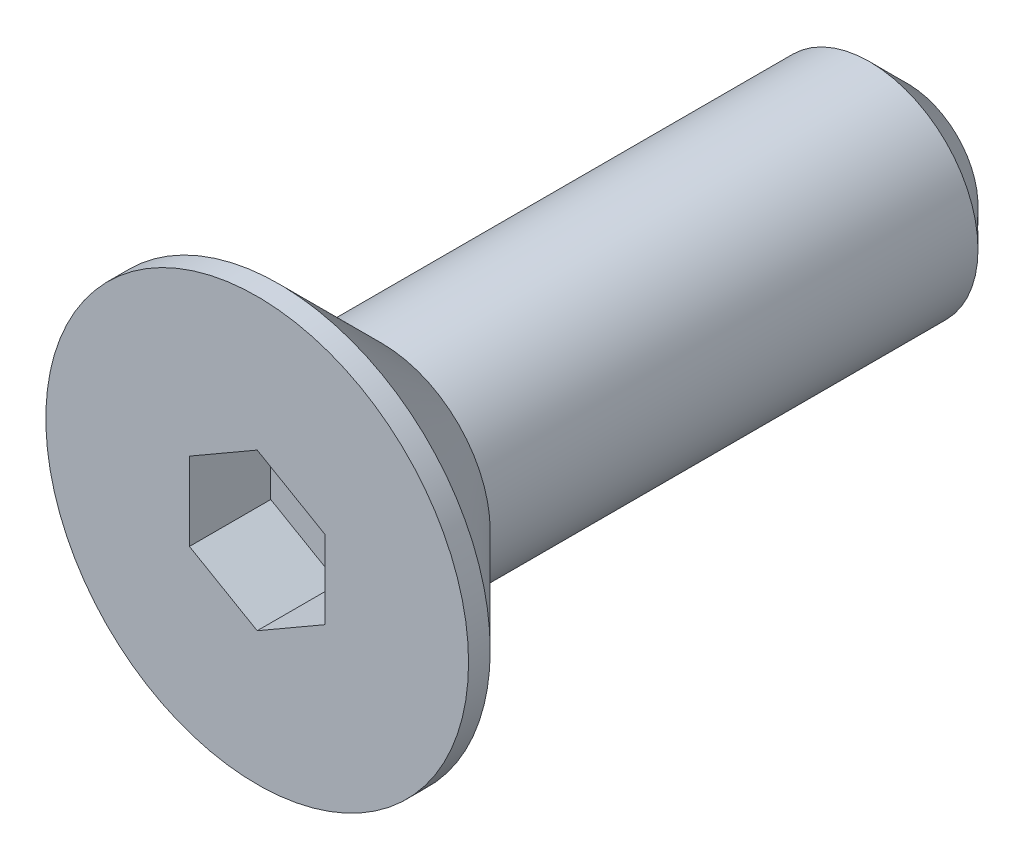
ISO-10303-21;
HEADER;
FILE_DESCRIPTION(('STEP AP214'),'2;1');
FILE_NAME('part.step','',(''),(''),'','','');
FILE_SCHEMA(('AUTOMOTIVE_DESIGN { 1 0 10303 214 1 1 1 1 }'));
ENDSEC;
DATA;
#1=APPLICATION_CONTEXT('core data for automotive mechanical design processes');
#2=APPLICATION_PROTOCOL_DEFINITION('international standard','automotive_design',2000,#1);
#3=PRODUCT_CONTEXT('',#1,'mechanical');
#4=PRODUCT('Part','Part','',(#3));
#5=PRODUCT_RELATED_PRODUCT_CATEGORY('part','',(#4));
#6=PRODUCT_DEFINITION_FORMATION('','',#4);
#7=PRODUCT_DEFINITION_CONTEXT('part definition',#1,'design');
#8=PRODUCT_DEFINITION('design','',#6,#7);
#9=PRODUCT_DEFINITION_SHAPE('','',#8);
#10=(LENGTH_UNIT() NAMED_UNIT(*) SI_UNIT(.MILLI.,.METRE.));
#11=(NAMED_UNIT(*) PLANE_ANGLE_UNIT() SI_UNIT($,.RADIAN.));
#12=(NAMED_UNIT(*) SI_UNIT($,.STERADIAN.) SOLID_ANGLE_UNIT());
#13=UNCERTAINTY_MEASURE_WITH_UNIT(LENGTH_MEASURE(1.E-05),#10,'distance_accuracy_value','');
#14=(GEOMETRIC_REPRESENTATION_CONTEXT(3) GLOBAL_UNCERTAINTY_ASSIGNED_CONTEXT((#13)) GLOBAL_UNIT_ASSIGNED_CONTEXT((#10,
#11,#12)) REPRESENTATION_CONTEXT('',''));
#15=CARTESIAN_POINT('',(0.,0.,0.));
#16=DIRECTION('',(0.,0.,1.));
#17=DIRECTION('',(1.,0.,0.));
#18=AXIS2_PLACEMENT_3D('',#15,#16,#17);
#19=CARTESIAN_POINT('',(0.,0.,0.));
#20=DIRECTION('',(0.,0.,1.));
#21=DIRECTION('',(1.,0.,0.));
#22=AXIS2_PLACEMENT_3D('',#19,#20,#21);
#23=PLANE('',#22);
#24=DIRECTION('',(-0.866025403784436,0.5,0.));
#25=VECTOR('',#24,1.);
#26=CARTESIAN_POINT('',(1.25,0.721687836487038,0.));
#27=LINE('',#26,#25);
#28=CARTESIAN_POINT('',(1.25,0.721687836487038,0.));
#29=VERTEX_POINT('',#28);
#30=CARTESIAN_POINT('',(0.,1.44337567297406,0.));
#31=VERTEX_POINT('',#30);
#32=EDGE_CURVE('E29',#29,#31,#27,.T.);
#33=ORIENTED_EDGE('',*,*,#32,.F.);
#34=DIRECTION('',(0.,1.,0.));
#35=VECTOR('',#34,1.);
#36=CARTESIAN_POINT('',(1.25,-0.721687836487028,0.));
#37=LINE('',#36,#35);
#38=CARTESIAN_POINT('',(1.25,-0.721687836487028,0.));
#39=VERTEX_POINT('',#38);
#40=EDGE_CURVE('E112',#39,#29,#37,.T.);
#41=ORIENTED_EDGE('',*,*,#40,.F.);
#42=DIRECTION('',(0.866025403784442,0.5,0.));
#43=VECTOR('',#42,1.);
#44=CARTESIAN_POINT('',(0.,-1.44337567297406,0.));
#45=LINE('',#44,#43);
#46=CARTESIAN_POINT('',(0.,-1.44337567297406,0.));
#47=VERTEX_POINT('',#46);
#48=EDGE_CURVE('E110',#47,#39,#45,.T.);
#49=ORIENTED_EDGE('',*,*,#48,.F.);
#50=DIRECTION('',(0.866025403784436,-0.5,0.));
#51=VECTOR('',#50,1.);
#52=CARTESIAN_POINT('',(-1.25,-0.721687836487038,0.));
#53=LINE('',#52,#51);
#54=CARTESIAN_POINT('',(-1.25,-0.721687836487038,0.));
#55=VERTEX_POINT('',#54);
#56=EDGE_CURVE('E77',#55,#47,#53,.T.);
#57=ORIENTED_EDGE('',*,*,#56,.F.);
#58=DIRECTION('',(0.,-1.,0.));
#59=VECTOR('',#58,1.);
#60=CARTESIAN_POINT('',(-1.25,0.721687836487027,0.));
#61=LINE('',#60,#59);
#62=CARTESIAN_POINT('',(-1.25,0.721687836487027,0.));
#63=VERTEX_POINT('',#62);
#64=EDGE_CURVE('E106',#63,#55,#61,.T.);
#65=ORIENTED_EDGE('',*,*,#64,.F.);
#66=DIRECTION('',(-0.866025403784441,-0.5,0.));
#67=VECTOR('',#66,1.);
#68=CARTESIAN_POINT('',(0.,1.44337567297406,0.));
#69=LINE('',#68,#67);
#70=EDGE_CURVE('E103',#31,#63,#69,.T.);
#71=ORIENTED_EDGE('',*,*,#70,.F.);
#72=EDGE_LOOP('',(#33,#41,#49,#57,#65,#71));
#73=FACE_BOUND('',#72,.T.);
#74=CARTESIAN_POINT('',(0.,0.,0.));
#75=DIRECTION('',(0.,0.,1.));
#76=DIRECTION('',(1.,0.,0.));
#77=AXIS2_PLACEMENT_3D('',#74,#75,#76);
#78=CIRCLE('',#77,3.9);
#79=CARTESIAN_POINT('',(3.9,0.,0.));
#80=VERTEX_POINT('',#79);
#81=EDGE_CURVE('E127',#80,#80,#78,.T.);
#82=ORIENTED_EDGE('',*,*,#81,.T.);
#83=EDGE_LOOP('',(#82));
#84=FACE_BOUND('',#83,.T.);
#85=ADVANCED_FACE('F14',(#73,#84),#23,.T.);
#86=CARTESIAN_POINT('',(0.,0.,0.));
#87=DIRECTION('',(0.,0.,1.));
#88=DIRECTION('',(1.,0.,0.));
#89=AXIS2_PLACEMENT_3D('',#86,#87,#88);
#90=CYLINDRICAL_SURFACE('',#89,3.9);
#91=CARTESIAN_POINT('',(0.,0.,-0.399999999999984));
#92=DIRECTION('',(0.,0.,1.));
#93=DIRECTION('',(1.,0.,0.));
#94=AXIS2_PLACEMENT_3D('',#91,#92,#93);
#95=CIRCLE('',#94,3.9);
#96=CARTESIAN_POINT('',(3.9,0.,-0.399999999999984));
#97=VERTEX_POINT('',#96);
#98=EDGE_CURVE('E124',#97,#97,#95,.T.);
#99=ORIENTED_EDGE('',*,*,#98,.T.);
#100=EDGE_LOOP('',(#99));
#101=FACE_BOUND('',#100,.T.);
#102=ORIENTED_EDGE('',*,*,#81,.F.);
#103=EDGE_LOOP('',(#102));
#104=FACE_BOUND('',#103,.T.);
#105=ADVANCED_FACE('F151',(#101,#104),#90,.T.);
#106=CARTESIAN_POINT('',(0.,0.,-0.399999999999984));
#107=DIRECTION('',(0.,0.,1.));
#108=DIRECTION('',(1.,0.,0.));
#109=AXIS2_PLACEMENT_3D('',#106,#107,#108);
#110=CONICAL_SURFACE('',#109,3.9,0.785398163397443);
#111=CARTESIAN_POINT('',(0.,0.,-2.3));
#112=DIRECTION('',(0.,0.,1.));
#113=DIRECTION('',(1.,0.,0.));
#114=AXIS2_PLACEMENT_3D('',#111,#112,#113);
#115=CIRCLE('',#114,2.);
#116=CARTESIAN_POINT('',(2.,0.,-2.3));
#117=VERTEX_POINT('',#116);
#118=EDGE_CURVE('E116',#117,#117,#115,.T.);
#119=ORIENTED_EDGE('',*,*,#118,.T.);
#120=EDGE_LOOP('',(#119));
#121=FACE_BOUND('',#120,.T.);
#122=ORIENTED_EDGE('',*,*,#98,.F.);
#123=EDGE_LOOP('',(#122));
#124=FACE_BOUND('',#123,.T.);
#125=ADVANCED_FACE('F157',(#121,#124),#110,.T.);
#126=CARTESIAN_POINT('',(0.,0.,0.));
#127=DIRECTION('',(0.,0.,1.));
#128=DIRECTION('',(1.,0.,0.));
#129=AXIS2_PLACEMENT_3D('',#126,#127,#128);
#130=CYLINDRICAL_SURFACE('',#129,2.);
#131=CARTESIAN_POINT('',(0.,0.,-11.3));
#132=DIRECTION('',(0.,0.,-1.));
#133=DIRECTION('',(-1.,0.,0.));
#134=AXIS2_PLACEMENT_3D('',#131,#132,#133);
#135=CIRCLE('',#134,2.);
#136=CARTESIAN_POINT('',(-2.,0.,-11.3));
#137=VERTEX_POINT('',#136);
#138=EDGE_CURVE('E22',#137,#137,#135,.F.);
#139=ORIENTED_EDGE('',*,*,#138,.T.);
#140=EDGE_LOOP('',(#139));
#141=FACE_BOUND('',#140,.T.);
#142=ORIENTED_EDGE('',*,*,#118,.F.);
#143=EDGE_LOOP('',(#142));
#144=FACE_BOUND('',#143,.T.);
#145=ADVANCED_FACE('F132',(#141,#144),#130,.T.);
#146=CARTESIAN_POINT('',(2.,0.,-12.));
#147=DIRECTION('',(0.,0.,-1.));
#148=DIRECTION('',(-1.,0.,0.));
#149=AXIS2_PLACEMENT_3D('',#146,#147,#148);
#150=PLANE('',#149);
#151=CARTESIAN_POINT('',(0.,0.,-12.));
#152=DIRECTION('',(0.,0.,-1.));
#153=DIRECTION('',(-1.,0.,0.));
#154=AXIS2_PLACEMENT_3D('',#151,#152,#153);
#155=CIRCLE('',#154,1.3);
#156=CARTESIAN_POINT('',(-1.3,0.,-12.));
#157=VERTEX_POINT('',#156);
#158=EDGE_CURVE('E9',#157,#157,#155,.T.);
#159=ORIENTED_EDGE('',*,*,#158,.T.);
#160=EDGE_LOOP('',(#159));
#161=FACE_BOUND('',#160,.T.);
#162=ADVANCED_FACE('F137',(#161),#150,.T.);
#163=CARTESIAN_POINT('',(0.,0.,-11.3));
#164=DIRECTION('',(0.,0.,1.));
#165=DIRECTION('',(1.,0.,0.));
#166=AXIS2_PLACEMENT_3D('',#163,#164,#165);
#167=CONICAL_SURFACE('',#166,2.,0.785398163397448);
#168=ORIENTED_EDGE('',*,*,#158,.F.);
#169=EDGE_LOOP('',(#168));
#170=FACE_BOUND('',#169,.T.);
#171=ORIENTED_EDGE('',*,*,#138,.F.);
#172=EDGE_LOOP('',(#171));
#173=FACE_BOUND('',#172,.T.);
#174=ADVANCED_FACE('F16',(#170,#173),#167,.T.);
#175=CARTESIAN_POINT('',(1.25,0.721687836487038,-1.5));
#176=DIRECTION('',(0.500000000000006,0.866025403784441,0.));
#177=DIRECTION('',(-0.866025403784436,0.5,0.));
#178=AXIS2_PLACEMENT_3D('',#175,#176,#177);
#179=PLANE('',#178);
#180=ORIENTED_EDGE('',*,*,#32,.T.);
#181=DIRECTION('',(0.,0.,1.));
#182=VECTOR('',#181,1.);
#183=CARTESIAN_POINT('',(0.,1.44337567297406,-1.5));
#184=LINE('',#183,#182);
#185=CARTESIAN_POINT('',(0.,1.44337567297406,-1.5));
#186=VERTEX_POINT('',#185);
#187=EDGE_CURVE('E59',#186,#31,#184,.T.);
#188=ORIENTED_EDGE('',*,*,#187,.F.);
#189=DIRECTION('',(-0.866025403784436,0.5,0.));
#190=VECTOR('',#189,1.);
#191=CARTESIAN_POINT('',(1.25,0.721687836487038,-1.5));
#192=LINE('',#191,#190);
#193=CARTESIAN_POINT('',(1.25,0.721687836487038,-1.5));
#194=VERTEX_POINT('',#193);
#195=EDGE_CURVE('E114',#194,#186,#192,.T.);
#196=ORIENTED_EDGE('',*,*,#195,.F.);
#197=DIRECTION('',(0.,0.,1.));
#198=VECTOR('',#197,1.);
#199=CARTESIAN_POINT('',(1.25,0.721687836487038,-1.5));
#200=LINE('',#199,#198);
#201=EDGE_CURVE('E37',#194,#29,#200,.T.);
#202=ORIENTED_EDGE('',*,*,#201,.T.);
#203=EDGE_LOOP('',(#180,#188,#196,#202));
#204=FACE_BOUND('',#203,.T.);
#205=ADVANCED_FACE('F136',(#204),#179,.F.);
#206=CARTESIAN_POINT('',(1.25,-0.721687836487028,-1.5));
#207=DIRECTION('',(1.,0.,0.));
#208=DIRECTION('',(0.,0.,-1.));
#209=AXIS2_PLACEMENT_3D('',#206,#207,#208);
#210=PLANE('',#209);
#211=ORIENTED_EDGE('',*,*,#40,.T.);
#212=ORIENTED_EDGE('',*,*,#201,.F.);
#213=DIRECTION('',(0.,1.,0.));
#214=VECTOR('',#213,1.);
#215=CARTESIAN_POINT('',(1.25,-0.721687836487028,-1.5));
#216=LINE('',#215,#214);
#217=CARTESIAN_POINT('',(1.25,-0.721687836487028,-1.5));
#218=VERTEX_POINT('',#217);
#219=EDGE_CURVE('E89',#218,#194,#216,.T.);
#220=ORIENTED_EDGE('',*,*,#219,.F.);
#221=DIRECTION('',(0.,0.,1.));
#222=VECTOR('',#221,1.);
#223=CARTESIAN_POINT('',(1.25,-0.721687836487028,-1.5));
#224=LINE('',#223,#222);
#225=EDGE_CURVE('E81',#218,#39,#224,.T.);
#226=ORIENTED_EDGE('',*,*,#225,.T.);
#227=EDGE_LOOP('',(#211,#212,#220,#226));
#228=FACE_BOUND('',#227,.T.);
#229=ADVANCED_FACE('F145',(#228),#210,.F.);
#230=CARTESIAN_POINT('',(0.,-1.44337567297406,-1.5));
#231=DIRECTION('',(0.5,-0.866025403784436,0.));
#232=DIRECTION('',(0.866025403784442,0.5,0.));
#233=AXIS2_PLACEMENT_3D('',#230,#231,#232);
#234=PLANE('',#233);
#235=ORIENTED_EDGE('',*,*,#48,.T.);
#236=ORIENTED_EDGE('',*,*,#225,.F.);
#237=DIRECTION('',(0.866025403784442,0.5,0.));
#238=VECTOR('',#237,1.);
#239=CARTESIAN_POINT('',(0.,-1.44337567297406,-1.5));
#240=LINE('',#239,#238);
#241=CARTESIAN_POINT('',(0.,-1.44337567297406,-1.5));
#242=VERTEX_POINT('',#241);
#243=EDGE_CURVE('E85',#242,#218,#240,.T.);
#244=ORIENTED_EDGE('',*,*,#243,.F.);
#245=DIRECTION('',(0.,0.,1.));
#246=VECTOR('',#245,1.);
#247=CARTESIAN_POINT('',(0.,-1.44337567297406,-1.5));
#248=LINE('',#247,#246);
#249=EDGE_CURVE('E70',#242,#47,#248,.T.);
#250=ORIENTED_EDGE('',*,*,#249,.T.);
#251=EDGE_LOOP('',(#235,#236,#244,#250));
#252=FACE_BOUND('',#251,.T.);
#253=ADVANCED_FACE('F86',(#252),#234,.F.);
#254=CARTESIAN_POINT('',(-1.25,-0.721687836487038,-1.5));
#255=DIRECTION('',(-0.500000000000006,-0.866025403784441,0.));
#256=DIRECTION('',(0.866025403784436,-0.5,0.));
#257=AXIS2_PLACEMENT_3D('',#254,#255,#256);
#258=PLANE('',#257);
#259=ORIENTED_EDGE('',*,*,#56,.T.);
#260=ORIENTED_EDGE('',*,*,#249,.F.);
#261=DIRECTION('',(0.866025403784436,-0.5,0.));
#262=VECTOR('',#261,1.);
#263=CARTESIAN_POINT('',(-1.25,-0.721687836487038,-1.5));
#264=LINE('',#263,#262);
#265=CARTESIAN_POINT('',(-1.25,-0.721687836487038,-1.5));
#266=VERTEX_POINT('',#265);
#267=EDGE_CURVE('E74',#266,#242,#264,.T.);
#268=ORIENTED_EDGE('',*,*,#267,.F.);
#269=DIRECTION('',(0.,0.,1.));
#270=VECTOR('',#269,1.);
#271=CARTESIAN_POINT('',(-1.25,-0.721687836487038,-1.5));
#272=LINE('',#271,#270);
#273=EDGE_CURVE('E82',#266,#55,#272,.T.);
#274=ORIENTED_EDGE('',*,*,#273,.T.);
#275=EDGE_LOOP('',(#259,#260,#268,#274));
#276=FACE_BOUND('',#275,.T.);
#277=ADVANCED_FACE('F72',(#276),#258,.F.);
#278=CARTESIAN_POINT('',(-1.25,0.721687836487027,-1.5));
#279=DIRECTION('',(-1.,0.,0.));
#280=DIRECTION('',(0.,0.,1.));
#281=AXIS2_PLACEMENT_3D('',#278,#279,#280);
#282=PLANE('',#281);
#283=ORIENTED_EDGE('',*,*,#64,.T.);
#284=ORIENTED_EDGE('',*,*,#273,.F.);
#285=DIRECTION('',(0.,-1.,0.));
#286=VECTOR('',#285,1.);
#287=CARTESIAN_POINT('',(-1.25,0.721687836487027,-1.5));
#288=LINE('',#287,#286);
#289=CARTESIAN_POINT('',(-1.25,0.721687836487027,-1.5));
#290=VERTEX_POINT('',#289);
#291=EDGE_CURVE('E95',#290,#266,#288,.T.);
#292=ORIENTED_EDGE('',*,*,#291,.F.);
#293=DIRECTION('',(0.,0.,1.));
#294=VECTOR('',#293,1.);
#295=CARTESIAN_POINT('',(-1.25,0.721687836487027,-1.5));
#296=LINE('',#295,#294);
#297=EDGE_CURVE('E119',#290,#63,#296,.T.);
#298=ORIENTED_EDGE('',*,*,#297,.T.);
#299=EDGE_LOOP('',(#283,#284,#292,#298));
#300=FACE_BOUND('',#299,.T.);
#301=ADVANCED_FACE('F170',(#300),#282,.F.);
#302=CARTESIAN_POINT('',(0.,1.44337567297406,-1.5));
#303=DIRECTION('',(-0.5,0.866025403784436,0.));
#304=DIRECTION('',(-0.866025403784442,-0.5,0.));
#305=AXIS2_PLACEMENT_3D('',#302,#303,#304);
#306=PLANE('',#305);
#307=ORIENTED_EDGE('',*,*,#70,.T.);
#308=ORIENTED_EDGE('',*,*,#297,.F.);
#309=DIRECTION('',(-0.866025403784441,-0.5,0.));
#310=VECTOR('',#309,1.);
#311=CARTESIAN_POINT('',(0.,1.44337567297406,-1.5));
#312=LINE('',#311,#310);
#313=EDGE_CURVE('E97',#186,#290,#312,.T.);
#314=ORIENTED_EDGE('',*,*,#313,.F.);
#315=ORIENTED_EDGE('',*,*,#187,.T.);
#316=EDGE_LOOP('',(#307,#308,#314,#315));
#317=FACE_BOUND('',#316,.T.);
#318=ADVANCED_FACE('F167',(#317),#306,.F.);
#319=CARTESIAN_POINT('',(0.,1.44337567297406,-1.5));
#320=DIRECTION('',(0.,0.,1.));
#321=DIRECTION('',(1.,0.,0.));
#322=AXIS2_PLACEMENT_3D('',#319,#320,#321);
#323=PLANE('',#322);
#324=ORIENTED_EDGE('',*,*,#195,.T.);
#325=ORIENTED_EDGE('',*,*,#313,.T.);
#326=ORIENTED_EDGE('',*,*,#291,.T.);
#327=ORIENTED_EDGE('',*,*,#267,.T.);
#328=ORIENTED_EDGE('',*,*,#243,.T.);
#329=ORIENTED_EDGE('',*,*,#219,.T.);
#330=EDGE_LOOP('',(#324,#325,#326,#327,#328,#329));
#331=FACE_BOUND('',#330,.T.);
#332=ADVANCED_FACE('F92',(#331),#323,.T.);
#333=CLOSED_SHELL('',(#85,#105,#125,#145,#162,#174,#205,#229,#253,#277,#301,#318,#332));
#334=MANIFOLD_SOLID_BREP('B1',#333);
#335=ADVANCED_BREP_SHAPE_REPRESENTATION('',(#18,#334),#14);
#336=SHAPE_DEFINITION_REPRESENTATION(#9,#335);
ENDSEC;
END-ISO-10303-21;
